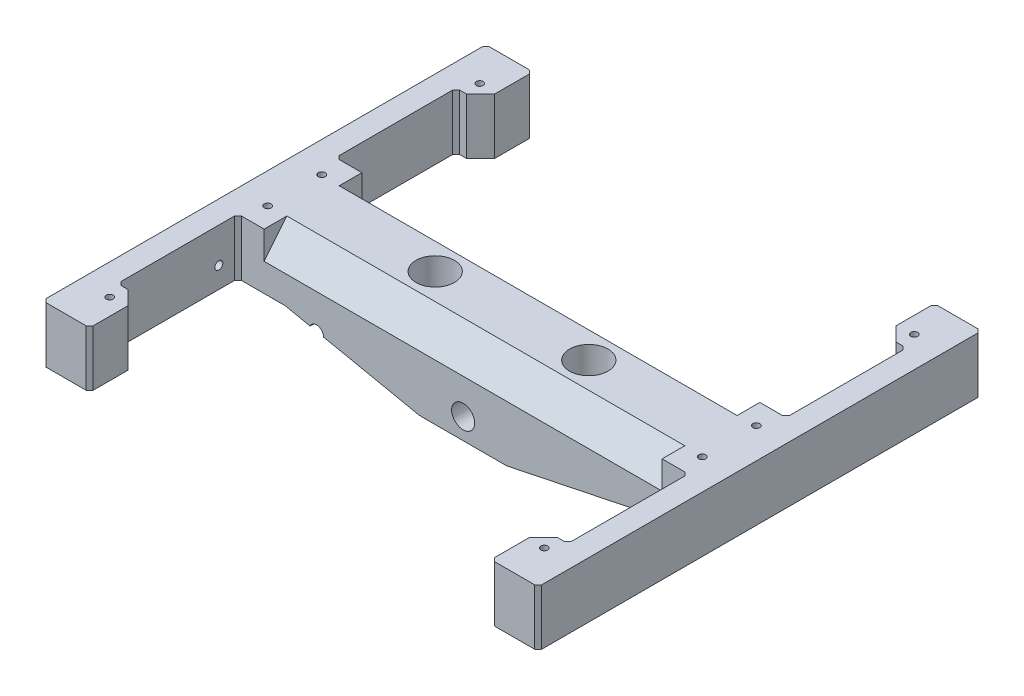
from build123d import *

# Parameters (mm, degrees)
BOSS_EXTRU_1_DEPTH      = 24
ESQUISSE2_R             = 3.3
ENL_V_MAT_EXTRU_1_DEPTH = 99.230596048
ENL_V_MAT_EXTRU_2_DEPTH = 7.5
ESQUISSE5_R             = 5.5
ENL_V_MAT_EXTRU_3_DEPTH = 99.230596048
ESQUISSE6_R             = 1
ENL_V_MAT_EXTRU_4_DEPTH = 5
BOSS_EXTRU_2_DEPTH      = 6.5
ENL_V_MAT_EXTRU_5_REACH = 114.786
ESQUISSE8_R             = 1.25
CONG_1_R                = 2
CONG_2_R                = 2
CHANFREIN2_SIZE         = 1
ENL_V_MAT_EXTRU_6_DEPTH = 57
ENL_V_MAT_EXTRU_7_REACH = 110.709
ESQUISSE11_R            = 2
ESQUISSE12_R            = 1.1
ENL_V_MAT_EXTRU_8_DEPTH = 10
ENL_V_MAT_EXTRU_9_REACH = 160.008
ESQUISSE13_R            = 1.15


with BuildPart() as part:
    # Esquisse1 → Boss.-Extru.1 (new body)
    with BuildSketch(Plane(origin=(0, 0, 0), x_dir=(1, 0, 0), z_dir=(0, 1, 0))):
        Polygon((-71, 63.5), (-71, 0), (71, 0), (71, 63.5), (57.5, 63.5), (57.5, 52.5), (61.5, 48.5), (64.5, 48.5), (64.5, 14), (-64.5, 14), (-64.5, 48.5), (-61.5, 48.5), (-57.5, 52.5), (-57.5, 63.5), align=None)
    boss_extru_1 = extrude(amount=-BOSS_EXTRU_1_DEPTH)

    # Esquisse2 → Enl_v. mat.-Extru.1 (cut, through all)
    with BuildSketch(Plane.XY):
        with Locations((0, -18)):
            Circle(ESQUISSE2_R)
        Polygon((-71, -16), (-51, -16), (-12.5, -24), (12.5, -24), (51, -16), (71, -16), (71, -45.368084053), (-71, -45.368084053), align=None)
    enl_v_mat_extru_1 = extrude(amount=-ENL_V_MAT_EXTRU_1_DEPTH, mode=Mode.SUBTRACT)

    # Sym_trie1: Boss.-Extru.1, Enl_v. mat.-Extru.1 across plane
    add(boss_extru_1.mirror(Plane.XY))
    add(enl_v_mat_extru_1.mirror(Plane.XY), mode=Mode.SUBTRACT)

    # Esquisse4 → Enl_v. mat.-Extru.2 (cut, symmetric)
    with BuildSketch(Plane.XY):
        Polygon((-31.75, -20), (-8, -8), (8, -8), (31.75, -20), (12.5, -24), (-12.5, -24), align=None)
    extrude(amount=ENL_V_MAT_EXTRU_2_DEPTH, both=True, mode=Mode.SUBTRACT)

    # Esquisse5 → Enl_v. mat.-Extru.3 (cut, through all)
    with BuildSketch(Plane(origin=(0, 0, 0), x_dir=(1, 0, 0), z_dir=(0, 1, 0))):
        with Locations(Location((-22, 0, 0), (0, 0, 270))):
            Circle(ESQUISSE5_R)
        with Locations(Location((22, 0, 0), (0, 0, 270))):
            Circle(ESQUISSE5_R)
    extrude(amount=-ENL_V_MAT_EXTRU_3_DEPTH, mode=Mode.SUBTRACT)

    # Esquisse6 → Enl_v. mat.-Extru.4 (cut)
    with BuildSketch(Plane(origin=(0, 0, 0), x_dir=(1, 0, 0), z_dir=(0, 1, 0))):
        with Locations(Location((-62.25, 53, 0), (0, 0, 270))):
            Circle(ESQUISSE6_R)
        with Locations(Location((-62.25, 7.75, 0), (0, 0, 270))):
            Circle(ESQUISSE6_R)
        with Locations(Location((-62.25, -7.75, 0), (0, 0, 270))):
            Circle(ESQUISSE6_R)
        with Locations(Location((-62.25, -53, 0), (0, 0, 270))):
            Circle(ESQUISSE6_R)
        with Locations(Location((62.25, -53, 0), (0, 0, 270))):
            Circle(ESQUISSE6_R)
        with Locations(Location((62.25, -7.75, 0), (0, 0, 270))):
            Circle(ESQUISSE6_R)
        with Locations(Location((62.25, 7.75, 0), (0, 0, 270))):
            Circle(ESQUISSE6_R)
        with Locations(Location((62.25, 53, 0), (0, 0, 270))):
            Circle(ESQUISSE6_R)
    extrude(amount=-ENL_V_MAT_EXTRU_4_DEPTH, mode=Mode.SUBTRACT)

    # Esquisse7 → Boss.-Extru.2 (add)
    with BuildSketch(Plane(origin=(0, 0, -14), x_dir=(-1, 0, 0), z_dir=(0, 0, -1))):
        Polygon((-31.75, -20), (-22.114318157, -22.002219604), (-23.310055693, -27.756706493), (-32.945737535, -25.75448689), align=None)
    extrude(amount=-BOSS_EXTRU_2_DEPTH)

    # Esquisse8 → Enl_v. mat.-Extru.5 (cut, up to next)
    with BuildSketch(Plane(origin=(16.816339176, 3.494304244, 0), x_dir=(0, 0, 1), z_dir=(-0.9790860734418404, -0.2034464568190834, 0)), mode=Mode.PRIVATE) as enl_v_mat_extru_5_sk1:
        with Locations(Location((-10.279737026, -29.427296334, 0), (0, 0, 270))):
            Circle(ESQUISSE8_R)
    enl_v_mat_extru_5_tool1 = extrude(enl_v_mat_extru_5_sk1.sketch, amount=-ENL_V_MAT_EXTRU_5_REACH, mode=Mode.PRIVATE) & part.part
    add(enl_v_mat_extru_5_tool1.solids().sort_by_distance((22.803218, -25.317552, -10.279737))[0], mode=Mode.SUBTRACT)

    # Cong_1
    cong_1_edges = [part.edges().sort_by_distance(p)[0] for p in [
        (28.127896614, -26.755596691, -14),
        (28.127896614, -26.755596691, -7.5),
    ]]
    fillet(cong_1_edges, radius=CONG_1_R)

    # Cong_2
    cong_2_edges = [part.edges().sort_by_distance(p)[0] for p in [
        (-22.125, -22, 7.5),
        (0, -24, 7.5),
        (22.125, -22, 7.5),
        (-22.125, -22, -7.5),
        (17.307159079, -23.001109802, -7.5),
        (0, -24, -7.5),
    ]]
    fillet(cong_2_edges, radius=CONG_2_R)

    # Chanfrein2
    chanfrein2_edges = [part.edges().sort_by_distance(p)[0] for p in [
        (-71, -8, 63.5),
        (-57.5, -8, 63.5),
        (57.5, -8, 63.5),
        (71, -8, 63.5),
        (64.5, -8, 48.5),
        (64.5, -8, 14),
        (-64.5, -8, 14),
        (-64.5, -8, 48.5),
        (-71, -8, -63.5),
        (71, -8, -63.5),
        (57.5, -8, -63.5),
        (64.5, -8, -48.5),
        (64.5, -8, -14),
        (-64.5, -8, -14),
        (-64.5, -8, -48.5),
        (-57.5, -8, -63.5),
    ]]
    chamfer(chanfrein2_edges, length=CHANFREIN2_SIZE)

    # Esquisse10 → Enl_v. mat.-Extru.6 (cut, symmetric)
    with BuildSketch(Plane(origin=(0, 0, 0), x_dir=(0, 0, -1), z_dir=(1, 0, 0))):
        Polygon((-7.5, 0), (-14, -8), (-14, 0), align=None)
        Polygon((14, 0), (14, -8), (7.5, 0), align=None)
    extrude(amount=ENL_V_MAT_EXTRU_6_DEPTH, both=True, mode=Mode.SUBTRACT)

    # Esquisse11 → Enl_v. mat.-Extru.7 (cut, up to next)
    with BuildSketch(Plane(origin=(0, 0, -14), x_dir=(-1, 0, 0), z_dir=(0, 0, -1)), mode=Mode.PRIVATE) as enl_v_mat_extru_7_sk1:
        with Locations((42, -18.261519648)):
            Circle(ESQUISSE11_R)
    enl_v_mat_extru_7_tool1 = extrude(enl_v_mat_extru_7_sk1.sketch, amount=-ENL_V_MAT_EXTRU_7_REACH, mode=Mode.PRIVATE) & part.part
    add(enl_v_mat_extru_7_tool1.solids().sort_by_distance((-42, -18.26152, -14))[0], mode=Mode.SUBTRACT)

    # Esquisse12 → Enl_v. mat.-Extru.8 (cut)
    with BuildSketch(Plane(origin=(-5.297978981, -25.496523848, 0), x_dir=(0.9790860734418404, -0.2034464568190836, 0), z_dir=(-0.2034464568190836, -0.9790860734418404, 0))):
        with Locations((-32.643428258, 10.5)):
            Circle(ESQUISSE12_R)
        with Locations((-42.243428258, -10.5)):
            Circle(ESQUISSE12_R)
    extrude(amount=-ENL_V_MAT_EXTRU_8_DEPTH, mode=Mode.SUBTRACT)

    # Esquisse13 → Enl_v. mat.-Extru.9 (cut, up to next)
    with BuildSketch(Plane.ZY.offset(71), mode=Mode.PRIVATE) as enl_v_mat_extru_9_sk1:
        with Locations((19.5, -10)):
            Circle(ESQUISSE13_R)
    enl_v_mat_extru_9_tool1 = extrude(enl_v_mat_extru_9_sk1.sketch, amount=-ENL_V_MAT_EXTRU_9_REACH, mode=Mode.PRIVATE) & part.part
    # Esquisse13 → Enl_v. mat.-Extru.9 (cut, up to next)
    with BuildSketch(Plane.ZY.offset(71), mode=Mode.PRIVATE) as enl_v_mat_extru_9_sk2:
        with Locations(Location((-19.5, -10, 0), (0, 0, 180))):
            Circle(ESQUISSE13_R)
    enl_v_mat_extru_9_tool2 = extrude(enl_v_mat_extru_9_sk2.sketch, amount=-ENL_V_MAT_EXTRU_9_REACH, mode=Mode.PRIVATE) & part.part
    add(enl_v_mat_extru_9_tool1.solids().sort_by_distance((-71, -10, 19.5))[0], mode=Mode.SUBTRACT)
    add(enl_v_mat_extru_9_tool2.solids().sort_by_distance((-71, -10, -19.5))[0], mode=Mode.SUBTRACT)


solid = part.part
